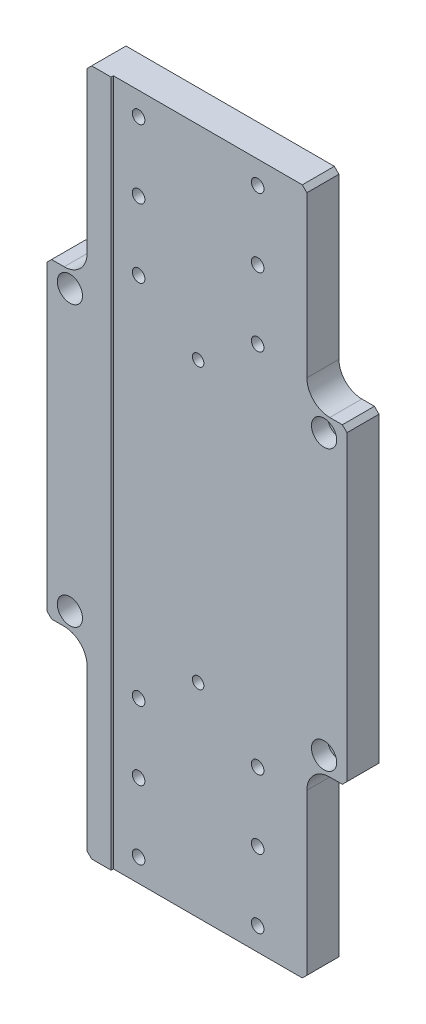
from build123d import *

# Parameters (mm, degrees)
SKETCH_1_W                   = 130
SKETCH_1_H                   = 136
SKETCH_1_W_2                 = 95
SKETCH_1_H_2                 = 300
EXTRUDE_1_DEPTH              = 7.5
SKETCH_2_W                   = 102
SKETCH_2_H                   = 300
CUT_EXTRUDE_1_DEPTH          = 1
HOLE_WIZARD_M6_1_D           = 6.6
HOLE_WIZARD_M6_1_CBORE_D     = 11
HOLE_WIZARD_M6_1_CBORE_DEPTH = 8
HOLE_WIZARD_M5_1_D           = 5.5
HOLE_WIZARD_M5_1_CBORE_D     = 9.5
HOLE_WIZARD_M5_1_CBORE_DEPTH = 7
PATTERN_LINEAR_1_COUNT       = 2
PATTERN_LINEAR_1_PITCH       = 220
F_5_0MM_1_D                  = 5
FILLET_1_R                   = 10
CHAMFER_1_SIZE               = 2


with BuildPart() as part:
    # Sketch 1 → Extrude 1 (new, symmetric)
    with BuildSketch(Plane.XY):
        Rectangle(SKETCH_1_W, SKETCH_1_H)
        Rectangle(SKETCH_1_W_2, SKETCH_1_H_2)
    extrude(amount=EXTRUDE_1_DEPTH, both=True)

    # Sketch 2 → Cut-Extrude 1 (cut)
    with BuildSketch(Plane.XY.offset(7.5)):
        with Locations((14, 0)):
            Rectangle(SKETCH_2_W, SKETCH_2_H)
    extrude(amount=-CUT_EXTRUDE_1_DEPTH, mode=Mode.SUBTRACT)

    # Hole Wizard M6 _ _ _ _ _1 (through all)
    with Locations(Plane.XY.offset(7.5)):
        with Locations((-55, 61), (55, 61), (-55, -61), (55, -61)):
            CounterBoreHole(HOLE_WIZARD_M6_1_D / 2, HOLE_WIZARD_M6_1_CBORE_D / 2, HOLE_WIZARD_M6_1_CBORE_DEPTH)

    # Hole Wizard M5 _ _ _ _ _1 (through all)
    with Locations(Plane(origin=(0, 0, -7.5), x_dir=(-1, 0, 0), z_dir=(0, 0, -1))):
        with Locations((-26, 140), (26, 140), (-26, 110), (26, 110), (-26, 80), (26, 80)):
            hole_wizard_m5_1 = CounterBoreHole(HOLE_WIZARD_M5_1_D / 2, HOLE_WIZARD_M5_1_CBORE_D / 2, HOLE_WIZARD_M5_1_CBORE_DEPTH)

    # Pattern Linear 1: Hole Wizard M5 _ _ _ _ _1 ×2
    with Locations(*[(0, -i * PATTERN_LINEAR_1_PITCH, 0) for i in range(1, PATTERN_LINEAR_1_COUNT)]):
        add(hole_wizard_m5_1, mode=Mode.SUBTRACT)

    # 5.0mm _ _1 (through all)
    with Locations(Plane.XY.offset(6.5)):
        with Locations((0, -61), (0, 61)):
            Hole(F_5_0MM_1_D / 2)

    # Fillet 1
    fillet_1_edges = [part.edges().sort_by_distance(p)[0] for p in [
        (47.5, -68, -0.5),
        (47.5, 68, -0.5),
        (-47.5, -68, 0),
        (-47.5, 68, 0),
    ]]
    fillet(fillet_1_edges, radius=FILLET_1_R)

    # Chamfer 1
    chamfer_1_edges = [part.edges().sort_by_distance(p)[0] for p in [
        (-65, 68, 0),
        (-65, -68, 0),
        (65, -68, -0.5),
        (65, 68, -0.5),
        (47.5, 150, -0.5),
        (47.5, -150, -0.5),
        (-47.5, 150, 0),
        (-47.5, -150, 0),
    ]]
    chamfer(chamfer_1_edges, length=CHAMFER_1_SIZE)


solid = part.part
